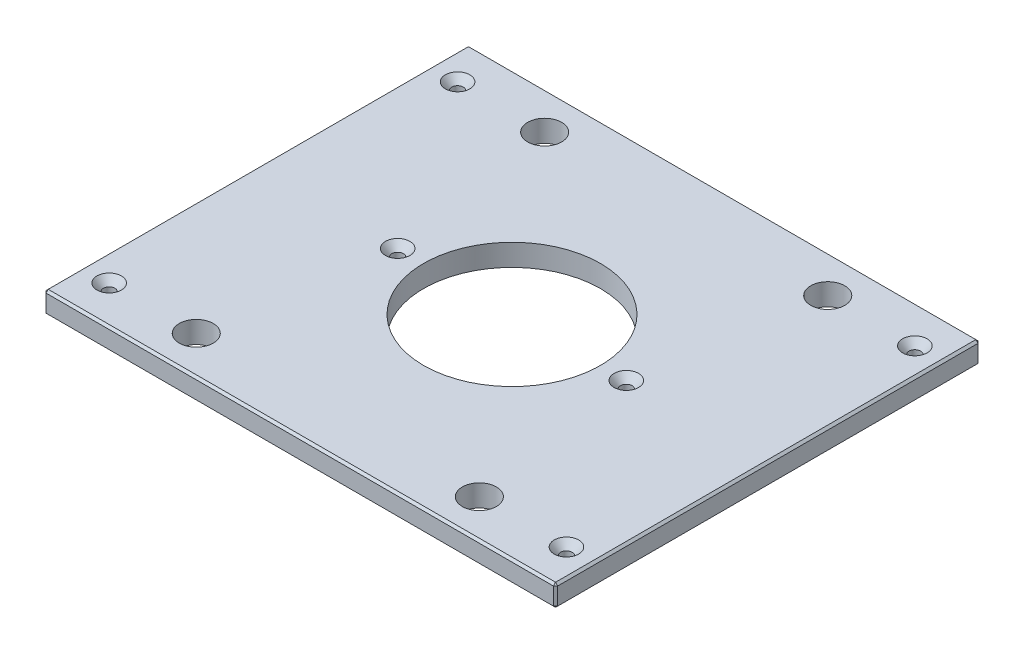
ISO-10303-21;
HEADER;
FILE_DESCRIPTION(('STEP AP214'),'2;1');
FILE_NAME('part.step','',(''),(''),'','','');
FILE_SCHEMA(('AUTOMOTIVE_DESIGN { 1 0 10303 214 1 1 1 1 }'));
ENDSEC;
DATA;
#1=APPLICATION_CONTEXT('core data for automotive mechanical design processes');
#2=APPLICATION_PROTOCOL_DEFINITION('international standard','automotive_design',2000,#1);
#3=PRODUCT_CONTEXT('',#1,'mechanical');
#4=PRODUCT('Part','Part','',(#3));
#5=PRODUCT_RELATED_PRODUCT_CATEGORY('part','',(#4));
#6=PRODUCT_DEFINITION_FORMATION('','',#4);
#7=PRODUCT_DEFINITION_CONTEXT('part definition',#1,'design');
#8=PRODUCT_DEFINITION('design','',#6,#7);
#9=PRODUCT_DEFINITION_SHAPE('','',#8);
#10=(LENGTH_UNIT() NAMED_UNIT(*) SI_UNIT(.MILLI.,.METRE.));
#11=(NAMED_UNIT(*) PLANE_ANGLE_UNIT() SI_UNIT($,.RADIAN.));
#12=(NAMED_UNIT(*) SI_UNIT($,.STERADIAN.) SOLID_ANGLE_UNIT());
#13=UNCERTAINTY_MEASURE_WITH_UNIT(LENGTH_MEASURE(1.E-05),#10,'distance_accuracy_value','');
#14=(GEOMETRIC_REPRESENTATION_CONTEXT(3) GLOBAL_UNCERTAINTY_ASSIGNED_CONTEXT((#13)) GLOBAL_UNIT_ASSIGNED_CONTEXT((#10,
#11,#12)) REPRESENTATION_CONTEXT('',''));
#15=CARTESIAN_POINT('',(0.,0.,0.));
#16=DIRECTION('',(0.,0.,1.));
#17=DIRECTION('',(1.,0.,0.));
#18=AXIS2_PLACEMENT_3D('',#15,#16,#17);
#19=CARTESIAN_POINT('',(-149.225,12.7,-123.825));
#20=DIRECTION('',(1.,0.,0.));
#21=DIRECTION('',(0.,0.,-1.));
#22=AXIS2_PLACEMENT_3D('',#19,#20,#21);
#23=PLANE('',#22);
#24=DIRECTION('',(0.,0.,-1.));
#25=VECTOR('',#24,1.);
#26=CARTESIAN_POINT('',(-149.225,11.4299999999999,-123.825));
#27=LINE('',#26,#25);
#28=CARTESIAN_POINT('',(-149.225,11.4299999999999,122.555));
#29=VERTEX_POINT('',#28);
#30=CARTESIAN_POINT('',(-149.225,11.4299999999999,-122.555));
#31=VERTEX_POINT('',#30);
#32=EDGE_CURVE('E136',#29,#31,#27,.T.);
#33=ORIENTED_EDGE('',*,*,#32,.T.);
#34=DIRECTION('',(0.,-1.,0.));
#35=VECTOR('',#34,1.);
#36=CARTESIAN_POINT('',(-149.225,12.7,-122.555));
#37=LINE('',#36,#35);
#38=CARTESIAN_POINT('',(-149.225,1.27000000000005,-122.555));
#39=VERTEX_POINT('',#38);
#40=EDGE_CURVE('E132',#31,#39,#37,.T.);
#41=ORIENTED_EDGE('',*,*,#40,.T.);
#42=DIRECTION('',(0.,0.,1.));
#43=VECTOR('',#42,1.);
#44=CARTESIAN_POINT('',(-149.225,1.27000000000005,-123.825));
#45=LINE('',#44,#43);
#46=CARTESIAN_POINT('',(-149.225,1.27000000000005,122.555));
#47=VERTEX_POINT('',#46);
#48=EDGE_CURVE('E127',#39,#47,#45,.T.);
#49=ORIENTED_EDGE('',*,*,#48,.T.);
#50=DIRECTION('',(0.,1.,0.));
#51=VECTOR('',#50,1.);
#52=CARTESIAN_POINT('',(-149.225,12.7,122.555));
#53=LINE('',#52,#51);
#54=EDGE_CURVE('E129',#47,#29,#53,.T.);
#55=ORIENTED_EDGE('',*,*,#54,.T.);
#56=EDGE_LOOP('',(#33,#41,#49,#55));
#57=FACE_BOUND('',#56,.T.);
#58=ADVANCED_FACE('F36',(#57),#23,.F.);
#59=CARTESIAN_POINT('',(-149.225,12.7,123.825));
#60=DIRECTION('',(0.,0.,-1.));
#61=DIRECTION('',(-1.,0.,0.));
#62=AXIS2_PLACEMENT_3D('',#59,#60,#61);
#63=PLANE('',#62);
#64=DIRECTION('',(1.,0.,0.));
#65=VECTOR('',#64,1.);
#66=CARTESIAN_POINT('',(-149.225,1.27000000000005,123.825));
#67=LINE('',#66,#65);
#68=CARTESIAN_POINT('',(-147.955,1.27000000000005,123.825));
#69=VERTEX_POINT('',#68);
#70=CARTESIAN_POINT('',(147.955,1.27000000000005,123.825));
#71=VERTEX_POINT('',#70);
#72=EDGE_CURVE('E59',#69,#71,#67,.T.);
#73=ORIENTED_EDGE('',*,*,#72,.T.);
#74=DIRECTION('',(0.,1.,0.));
#75=VECTOR('',#74,1.);
#76=CARTESIAN_POINT('',(147.955,12.7,123.825));
#77=LINE('',#76,#75);
#78=CARTESIAN_POINT('',(147.955,11.4299999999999,123.825));
#79=VERTEX_POINT('',#78);
#80=EDGE_CURVE('E11',#71,#79,#77,.T.);
#81=ORIENTED_EDGE('',*,*,#80,.T.);
#82=DIRECTION('',(-1.,0.,0.));
#83=VECTOR('',#82,1.);
#84=CARTESIAN_POINT('',(-149.225,11.4299999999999,123.825));
#85=LINE('',#84,#83);
#86=CARTESIAN_POINT('',(-147.955,11.4299999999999,123.825));
#87=VERTEX_POINT('',#86);
#88=EDGE_CURVE('E45',#79,#87,#85,.T.);
#89=ORIENTED_EDGE('',*,*,#88,.T.);
#90=DIRECTION('',(0.,-1.,0.));
#91=VECTOR('',#90,1.);
#92=CARTESIAN_POINT('',(-147.955,12.7,123.825));
#93=LINE('',#92,#91);
#94=EDGE_CURVE('E280',#87,#69,#93,.T.);
#95=ORIENTED_EDGE('',*,*,#94,.T.);
#96=EDGE_LOOP('',(#73,#81,#89,#95));
#97=FACE_BOUND('',#96,.T.);
#98=ADVANCED_FACE('F349',(#97),#63,.F.);
#99=CARTESIAN_POINT('',(149.225,12.7,-123.825));
#100=DIRECTION('',(-1.,0.,0.));
#101=DIRECTION('',(0.,0.,1.));
#102=AXIS2_PLACEMENT_3D('',#99,#100,#101);
#103=PLANE('',#102);
#104=DIRECTION('',(0.,0.,-1.));
#105=VECTOR('',#104,1.);
#106=CARTESIAN_POINT('',(149.225,1.27000000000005,-123.825));
#107=LINE('',#106,#105);
#108=CARTESIAN_POINT('',(149.225,1.27000000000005,122.555));
#109=VERTEX_POINT('',#108);
#110=CARTESIAN_POINT('',(149.225,1.27000000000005,-122.555));
#111=VERTEX_POINT('',#110);
#112=EDGE_CURVE('E275',#109,#111,#107,.T.);
#113=ORIENTED_EDGE('',*,*,#112,.T.);
#114=DIRECTION('',(0.,1.,0.));
#115=VECTOR('',#114,1.);
#116=CARTESIAN_POINT('',(149.225,12.7,-122.555));
#117=LINE('',#116,#115);
#118=CARTESIAN_POINT('',(149.225,11.4299999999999,-122.555));
#119=VERTEX_POINT('',#118);
#120=EDGE_CURVE('E277',#111,#119,#117,.T.);
#121=ORIENTED_EDGE('',*,*,#120,.T.);
#122=DIRECTION('',(0.,0.,1.));
#123=VECTOR('',#122,1.);
#124=CARTESIAN_POINT('',(149.225,11.4299999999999,123.825));
#125=LINE('',#124,#123);
#126=CARTESIAN_POINT('',(149.225,11.4299999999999,122.555));
#127=VERTEX_POINT('',#126);
#128=EDGE_CURVE('E273',#119,#127,#125,.T.);
#129=ORIENTED_EDGE('',*,*,#128,.T.);
#130=DIRECTION('',(0.,-1.,0.));
#131=VECTOR('',#130,1.);
#132=CARTESIAN_POINT('',(149.225,12.7,122.555));
#133=LINE('',#132,#131);
#134=EDGE_CURVE('E271',#127,#109,#133,.T.);
#135=ORIENTED_EDGE('',*,*,#134,.T.);
#136=EDGE_LOOP('',(#113,#121,#129,#135));
#137=FACE_BOUND('',#136,.T.);
#138=ADVANCED_FACE('F336',(#137),#103,.F.);
#139=CARTESIAN_POINT('',(-149.225,12.7,-123.825));
#140=DIRECTION('',(0.,0.,1.));
#141=DIRECTION('',(1.,0.,0.));
#142=AXIS2_PLACEMENT_3D('',#139,#140,#141);
#143=PLANE('',#142);
#144=DIRECTION('',(-1.,0.,0.));
#145=VECTOR('',#144,1.);
#146=CARTESIAN_POINT('',(-149.225,1.27000000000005,-123.825));
#147=LINE('',#146,#145);
#148=CARTESIAN_POINT('',(147.955,1.27000000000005,-123.825));
#149=VERTEX_POINT('',#148);
#150=CARTESIAN_POINT('',(-147.955,1.27000000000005,-123.825));
#151=VERTEX_POINT('',#150);
#152=EDGE_CURVE('E247',#149,#151,#147,.T.);
#153=ORIENTED_EDGE('',*,*,#152,.T.);
#154=DIRECTION('',(0.,1.,0.));
#155=VECTOR('',#154,1.);
#156=CARTESIAN_POINT('',(-147.955,12.7,-123.825));
#157=LINE('',#156,#155);
#158=CARTESIAN_POINT('',(-147.955,11.4299999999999,-123.825));
#159=VERTEX_POINT('',#158);
#160=EDGE_CURVE('E251',#151,#159,#157,.T.);
#161=ORIENTED_EDGE('',*,*,#160,.T.);
#162=DIRECTION('',(1.,0.,0.));
#163=VECTOR('',#162,1.);
#164=CARTESIAN_POINT('',(149.225,11.4299999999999,-123.825));
#165=LINE('',#164,#163);
#166=CARTESIAN_POINT('',(147.955,11.4299999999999,-123.825));
#167=VERTEX_POINT('',#166);
#168=EDGE_CURVE('E249',#159,#167,#165,.T.);
#169=ORIENTED_EDGE('',*,*,#168,.T.);
#170=DIRECTION('',(0.,-1.,0.));
#171=VECTOR('',#170,1.);
#172=CARTESIAN_POINT('',(147.955,12.7,-123.825));
#173=LINE('',#172,#171);
#174=EDGE_CURVE('E245',#167,#149,#173,.T.);
#175=ORIENTED_EDGE('',*,*,#174,.T.);
#176=EDGE_LOOP('',(#153,#161,#169,#175));
#177=FACE_BOUND('',#176,.T.);
#178=ADVANCED_FACE('F310',(#177),#143,.F.);
#179=CARTESIAN_POINT('',(0.,12.7,0.));
#180=DIRECTION('',(0.,1.,0.));
#181=DIRECTION('',(0.,0.,1.));
#182=AXIS2_PLACEMENT_3D('',#179,#180,#181);
#183=PLANE('',#182);
#184=CARTESIAN_POINT('',(133.35,12.7,-101.6));
#185=DIRECTION('',(0.,1.,0.));
#186=DIRECTION('',(0.,0.,1.));
#187=AXIS2_PLACEMENT_3D('',#184,#185,#186);
#188=CIRCLE('',#187,7.13739999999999);
#189=CARTESIAN_POINT('',(133.35,12.7,-94.4626));
#190=VERTEX_POINT('',#189);
#191=EDGE_CURVE('E753',#190,#190,#188,.T.);
#192=ORIENTED_EDGE('',*,*,#191,.F.);
#193=EDGE_LOOP('',(#192));
#194=FACE_BOUND('',#193,.T.);
#195=CARTESIAN_POINT('',(133.35,12.7,101.6));
#196=DIRECTION('',(0.,1.,0.));
#197=DIRECTION('',(0.,0.,1.));
#198=AXIS2_PLACEMENT_3D('',#195,#196,#197);
#199=CIRCLE('',#198,7.13739999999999);
#200=CARTESIAN_POINT('',(133.35,12.7,108.7374));
#201=VERTEX_POINT('',#200);
#202=EDGE_CURVE('E757',#201,#201,#199,.T.);
#203=ORIENTED_EDGE('',*,*,#202,.F.);
#204=EDGE_LOOP('',(#203));
#205=FACE_BOUND('',#204,.T.);
#206=CARTESIAN_POINT('',(-133.35,12.7,101.6));
#207=DIRECTION('',(0.,1.,0.));
#208=DIRECTION('',(0.,0.,1.));
#209=AXIS2_PLACEMENT_3D('',#206,#207,#208);
#210=CIRCLE('',#209,7.13739999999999);
#211=CARTESIAN_POINT('',(-133.35,12.7,108.7374));
#212=VERTEX_POINT('',#211);
#213=EDGE_CURVE('E761',#212,#212,#210,.T.);
#214=ORIENTED_EDGE('',*,*,#213,.F.);
#215=EDGE_LOOP('',(#214));
#216=FACE_BOUND('',#215,.T.);
#217=CARTESIAN_POINT('',(-66.675,12.7,0.));
#218=DIRECTION('',(0.,1.,0.));
#219=DIRECTION('',(0.,0.,1.));
#220=AXIS2_PLACEMENT_3D('',#217,#218,#219);
#221=CIRCLE('',#220,7.1374);
#222=CARTESIAN_POINT('',(-66.675,12.7,7.1374));
#223=VERTEX_POINT('',#222);
#224=EDGE_CURVE('E765',#223,#223,#221,.T.);
#225=ORIENTED_EDGE('',*,*,#224,.F.);
#226=EDGE_LOOP('',(#225));
#227=FACE_BOUND('',#226,.T.);
#228=CARTESIAN_POINT('',(66.675,12.7,0.));
#229=DIRECTION('',(0.,1.,0.));
#230=DIRECTION('',(0.,0.,1.));
#231=AXIS2_PLACEMENT_3D('',#228,#229,#230);
#232=CIRCLE('',#231,7.1374);
#233=CARTESIAN_POINT('',(66.675,12.7,7.1374));
#234=VERTEX_POINT('',#233);
#235=EDGE_CURVE('E769',#234,#234,#232,.T.);
#236=ORIENTED_EDGE('',*,*,#235,.F.);
#237=EDGE_LOOP('',(#236));
#238=FACE_BOUND('',#237,.T.);
#239=CARTESIAN_POINT('',(-133.35,12.7,-101.6));
#240=DIRECTION('',(0.,1.,0.));
#241=DIRECTION('',(0.,0.,1.));
#242=AXIS2_PLACEMENT_3D('',#239,#240,#241);
#243=CIRCLE('',#242,7.13739999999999);
#244=CARTESIAN_POINT('',(-133.35,12.7,-94.4626));
#245=VERTEX_POINT('',#244);
#246=EDGE_CURVE('E772',#245,#245,#243,.T.);
#247=ORIENTED_EDGE('',*,*,#246,.F.);
#248=EDGE_LOOP('',(#247));
#249=FACE_BOUND('',#248,.T.);
#250=DIRECTION('',(0.,0.,-1.));
#251=VECTOR('',#250,1.);
#252=CARTESIAN_POINT('',(147.955,12.7,-123.825));
#253=LINE('',#252,#251);
#254=CARTESIAN_POINT('',(147.955,12.7,122.555));
#255=VERTEX_POINT('',#254);
#256=CARTESIAN_POINT('',(147.955,12.7,-122.555));
#257=VERTEX_POINT('',#256);
#258=EDGE_CURVE('E258',#255,#257,#253,.T.);
#259=ORIENTED_EDGE('',*,*,#258,.T.);
#260=DIRECTION('',(-1.,0.,0.));
#261=VECTOR('',#260,1.);
#262=CARTESIAN_POINT('',(-149.225,12.7,-122.555));
#263=LINE('',#262,#261);
#264=CARTESIAN_POINT('',(-147.955,12.7,-122.555));
#265=VERTEX_POINT('',#264);
#266=EDGE_CURVE('E260',#257,#265,#263,.T.);
#267=ORIENTED_EDGE('',*,*,#266,.T.);
#268=DIRECTION('',(0.,0.,1.));
#269=VECTOR('',#268,1.);
#270=CARTESIAN_POINT('',(-147.955,12.7,123.825));
#271=LINE('',#270,#269);
#272=CARTESIAN_POINT('',(-147.955,12.7,122.555));
#273=VERTEX_POINT('',#272);
#274=EDGE_CURVE('E256',#265,#273,#271,.T.);
#275=ORIENTED_EDGE('',*,*,#274,.T.);
#276=DIRECTION('',(1.,0.,0.));
#277=VECTOR('',#276,1.);
#278=CARTESIAN_POINT('',(149.225,12.7,122.555));
#279=LINE('',#278,#277);
#280=EDGE_CURVE('E254',#273,#255,#279,.T.);
#281=ORIENTED_EDGE('',*,*,#280,.T.);
#282=EDGE_LOOP('',(#259,#267,#275,#281));
#283=FACE_BOUND('',#282,.T.);
#284=CARTESIAN_POINT('',(82.55,12.7,-101.6));
#285=DIRECTION('',(0.,1.,0.));
#286=DIRECTION('',(0.,0.,1.));
#287=AXIS2_PLACEMENT_3D('',#284,#285,#286);
#288=CIRCLE('',#287,9.921875);
#289=CARTESIAN_POINT('',(82.55,12.7,-91.678125));
#290=VERTEX_POINT('',#289);
#291=EDGE_CURVE('E205',#290,#290,#288,.T.);
#292=ORIENTED_EDGE('',*,*,#291,.F.);
#293=EDGE_LOOP('',(#292));
#294=FACE_BOUND('',#293,.T.);
#295=CARTESIAN_POINT('',(-82.55,12.7,-101.6));
#296=DIRECTION('',(0.,1.,0.));
#297=DIRECTION('',(0.,0.,1.));
#298=AXIS2_PLACEMENT_3D('',#295,#296,#297);
#299=CIRCLE('',#298,9.921875);
#300=CARTESIAN_POINT('',(-82.55,12.7,-91.678125));
#301=VERTEX_POINT('',#300);
#302=EDGE_CURVE('E215',#301,#301,#299,.T.);
#303=ORIENTED_EDGE('',*,*,#302,.F.);
#304=EDGE_LOOP('',(#303));
#305=FACE_BOUND('',#304,.T.);
#306=CARTESIAN_POINT('',(82.55,12.7,101.6));
#307=DIRECTION('',(0.,1.,0.));
#308=DIRECTION('',(0.,0.,1.));
#309=AXIS2_PLACEMENT_3D('',#306,#307,#308);
#310=CIRCLE('',#309,9.921875);
#311=CARTESIAN_POINT('',(82.55,12.7,111.521875));
#312=VERTEX_POINT('',#311);
#313=EDGE_CURVE('E226',#312,#312,#310,.T.);
#314=ORIENTED_EDGE('',*,*,#313,.F.);
#315=EDGE_LOOP('',(#314));
#316=FACE_BOUND('',#315,.T.);
#317=CARTESIAN_POINT('',(-82.55,12.7,101.6));
#318=DIRECTION('',(0.,1.,0.));
#319=DIRECTION('',(0.,0.,1.));
#320=AXIS2_PLACEMENT_3D('',#317,#318,#319);
#321=CIRCLE('',#320,9.921875);
#322=CARTESIAN_POINT('',(-82.55,12.7,111.521875));
#323=VERTEX_POINT('',#322);
#324=EDGE_CURVE('E232',#323,#323,#321,.T.);
#325=ORIENTED_EDGE('',*,*,#324,.F.);
#326=EDGE_LOOP('',(#325));
#327=FACE_BOUND('',#326,.T.);
#328=CARTESIAN_POINT('',(0.,12.7,0.));
#329=DIRECTION('',(0.,1.,0.));
#330=DIRECTION('',(0.,0.,1.));
#331=AXIS2_PLACEMENT_3D('',#328,#329,#330);
#332=CIRCLE('',#331,51.562);
#333=CARTESIAN_POINT('',(0.,12.7,51.562));
#334=VERTEX_POINT('',#333);
#335=EDGE_CURVE('E238',#334,#334,#332,.T.);
#336=ORIENTED_EDGE('',*,*,#335,.F.);
#337=EDGE_LOOP('',(#336));
#338=FACE_BOUND('',#337,.T.);
#339=ADVANCED_FACE('F358',(#194,#205,#216,#227,#238,#249,#283,#294,#305,#316,#327,#338),#183,.T.);
#340=CARTESIAN_POINT('',(0.,0.,0.));
#341=DIRECTION('',(0.,1.,0.));
#342=DIRECTION('',(0.,0.,1.));
#343=AXIS2_PLACEMENT_3D('',#340,#341,#342);
#344=PLANE('',#343);
#345=CARTESIAN_POINT('',(133.35,0.,-101.6));
#346=DIRECTION('',(0.,1.,0.));
#347=DIRECTION('',(0.,0.,1.));
#348=AXIS2_PLACEMENT_3D('',#345,#346,#347);
#349=CIRCLE('',#348,3.3782);
#350=CARTESIAN_POINT('',(133.35,0.,-98.2218));
#351=VERTEX_POINT('',#350);
#352=EDGE_CURVE('E806',#351,#351,#349,.T.);
#353=ORIENTED_EDGE('',*,*,#352,.T.);
#354=EDGE_LOOP('',(#353));
#355=FACE_BOUND('',#354,.T.);
#356=CARTESIAN_POINT('',(133.35,0.,101.6));
#357=DIRECTION('',(0.,1.,0.));
#358=DIRECTION('',(0.,0.,1.));
#359=AXIS2_PLACEMENT_3D('',#356,#357,#358);
#360=CIRCLE('',#359,3.3782);
#361=CARTESIAN_POINT('',(133.35,0.,104.9782));
#362=VERTEX_POINT('',#361);
#363=EDGE_CURVE('E799',#362,#362,#360,.T.);
#364=ORIENTED_EDGE('',*,*,#363,.T.);
#365=EDGE_LOOP('',(#364));
#366=FACE_BOUND('',#365,.T.);
#367=CARTESIAN_POINT('',(-133.35,0.,101.6));
#368=DIRECTION('',(0.,1.,0.));
#369=DIRECTION('',(0.,0.,1.));
#370=AXIS2_PLACEMENT_3D('',#367,#368,#369);
#371=CIRCLE('',#370,3.3782);
#372=CARTESIAN_POINT('',(-133.35,0.,104.9782));
#373=VERTEX_POINT('',#372);
#374=EDGE_CURVE('E792',#373,#373,#371,.T.);
#375=ORIENTED_EDGE('',*,*,#374,.T.);
#376=EDGE_LOOP('',(#375));
#377=FACE_BOUND('',#376,.T.);
#378=CARTESIAN_POINT('',(-66.675,0.,0.));
#379=DIRECTION('',(0.,1.,0.));
#380=DIRECTION('',(0.,0.,1.));
#381=AXIS2_PLACEMENT_3D('',#378,#379,#380);
#382=CIRCLE('',#381,3.3782);
#383=CARTESIAN_POINT('',(-66.675,0.,3.3782));
#384=VERTEX_POINT('',#383);
#385=EDGE_CURVE('E785',#384,#384,#382,.T.);
#386=ORIENTED_EDGE('',*,*,#385,.T.);
#387=EDGE_LOOP('',(#386));
#388=FACE_BOUND('',#387,.T.);
#389=CARTESIAN_POINT('',(66.675,0.,0.));
#390=DIRECTION('',(0.,1.,0.));
#391=DIRECTION('',(0.,0.,1.));
#392=AXIS2_PLACEMENT_3D('',#389,#390,#391);
#393=CIRCLE('',#392,3.3782);
#394=CARTESIAN_POINT('',(66.675,0.,3.3782));
#395=VERTEX_POINT('',#394);
#396=EDGE_CURVE('E775',#395,#395,#393,.T.);
#397=ORIENTED_EDGE('',*,*,#396,.T.);
#398=EDGE_LOOP('',(#397));
#399=FACE_BOUND('',#398,.T.);
#400=CARTESIAN_POINT('',(-133.35,0.,-101.6));
#401=DIRECTION('',(0.,1.,0.));
#402=DIRECTION('',(0.,0.,1.));
#403=AXIS2_PLACEMENT_3D('',#400,#401,#402);
#404=CIRCLE('',#403,3.3782);
#405=CARTESIAN_POINT('',(-133.35,0.,-98.2218));
#406=VERTEX_POINT('',#405);
#407=EDGE_CURVE('E218',#406,#406,#404,.T.);
#408=ORIENTED_EDGE('',*,*,#407,.T.);
#409=EDGE_LOOP('',(#408));
#410=FACE_BOUND('',#409,.T.);
#411=DIRECTION('',(0.,0.,-1.));
#412=VECTOR('',#411,1.);
#413=CARTESIAN_POINT('',(-147.955,0.,0.));
#414=LINE('',#413,#412);
#415=CARTESIAN_POINT('',(-147.955,0.,122.555));
#416=VERTEX_POINT('',#415);
#417=CARTESIAN_POINT('',(-147.955,0.,-122.555));
#418=VERTEX_POINT('',#417);
#419=EDGE_CURVE('E159',#416,#418,#414,.T.);
#420=ORIENTED_EDGE('',*,*,#419,.T.);
#421=DIRECTION('',(1.,0.,0.));
#422=VECTOR('',#421,1.);
#423=CARTESIAN_POINT('',(0.,0.,-122.555));
#424=LINE('',#423,#422);
#425=CARTESIAN_POINT('',(147.955,0.,-122.555));
#426=VERTEX_POINT('',#425);
#427=EDGE_CURVE('E268',#418,#426,#424,.T.);
#428=ORIENTED_EDGE('',*,*,#427,.T.);
#429=DIRECTION('',(0.,0.,1.));
#430=VECTOR('',#429,1.);
#431=CARTESIAN_POINT('',(147.955,0.,0.));
#432=LINE('',#431,#430);
#433=CARTESIAN_POINT('',(147.955,0.,122.555));
#434=VERTEX_POINT('',#433);
#435=EDGE_CURVE('E266',#426,#434,#432,.T.);
#436=ORIENTED_EDGE('',*,*,#435,.T.);
#437=DIRECTION('',(-1.,0.,0.));
#438=VECTOR('',#437,1.);
#439=CARTESIAN_POINT('',(0.,0.,122.555));
#440=LINE('',#439,#438);
#441=EDGE_CURVE('E263',#434,#416,#440,.T.);
#442=ORIENTED_EDGE('',*,*,#441,.T.);
#443=EDGE_LOOP('',(#420,#428,#436,#442));
#444=FACE_BOUND('',#443,.T.);
#445=CARTESIAN_POINT('',(82.55,0.,-101.6));
#446=DIRECTION('',(0.,1.,0.));
#447=DIRECTION('',(0.,0.,1.));
#448=AXIS2_PLACEMENT_3D('',#445,#446,#447);
#449=CIRCLE('',#448,9.921875);
#450=CARTESIAN_POINT('',(82.55,0.,-91.678125));
#451=VERTEX_POINT('',#450);
#452=EDGE_CURVE('E210',#451,#451,#449,.T.);
#453=ORIENTED_EDGE('',*,*,#452,.T.);
#454=EDGE_LOOP('',(#453));
#455=FACE_BOUND('',#454,.T.);
#456=CARTESIAN_POINT('',(-82.55,0.,-101.6));
#457=DIRECTION('',(0.,1.,0.));
#458=DIRECTION('',(0.,0.,1.));
#459=AXIS2_PLACEMENT_3D('',#456,#457,#458);
#460=CIRCLE('',#459,9.921875);
#461=CARTESIAN_POINT('',(-82.55,0.,-91.678125));
#462=VERTEX_POINT('',#461);
#463=EDGE_CURVE('E223',#462,#462,#460,.T.);
#464=ORIENTED_EDGE('',*,*,#463,.T.);
#465=EDGE_LOOP('',(#464));
#466=FACE_BOUND('',#465,.T.);
#467=CARTESIAN_POINT('',(82.55,0.,101.6));
#468=DIRECTION('',(0.,1.,0.));
#469=DIRECTION('',(0.,0.,1.));
#470=AXIS2_PLACEMENT_3D('',#467,#468,#469);
#471=CIRCLE('',#470,9.921875);
#472=CARTESIAN_POINT('',(82.55,0.,111.521875));
#473=VERTEX_POINT('',#472);
#474=EDGE_CURVE('E229',#473,#473,#471,.T.);
#475=ORIENTED_EDGE('',*,*,#474,.T.);
#476=EDGE_LOOP('',(#475));
#477=FACE_BOUND('',#476,.T.);
#478=CARTESIAN_POINT('',(-82.55,0.,101.6));
#479=DIRECTION('',(0.,1.,0.));
#480=DIRECTION('',(0.,0.,1.));
#481=AXIS2_PLACEMENT_3D('',#478,#479,#480);
#482=CIRCLE('',#481,9.921875);
#483=CARTESIAN_POINT('',(-82.55,0.,111.521875));
#484=VERTEX_POINT('',#483);
#485=EDGE_CURVE('E235',#484,#484,#482,.T.);
#486=ORIENTED_EDGE('',*,*,#485,.T.);
#487=EDGE_LOOP('',(#486));
#488=FACE_BOUND('',#487,.T.);
#489=CARTESIAN_POINT('',(0.,0.,0.));
#490=DIRECTION('',(0.,1.,0.));
#491=DIRECTION('',(0.,0.,1.));
#492=AXIS2_PLACEMENT_3D('',#489,#490,#491);
#493=CIRCLE('',#492,51.562);
#494=CARTESIAN_POINT('',(0.,0.,51.562));
#495=VERTEX_POINT('',#494);
#496=EDGE_CURVE('E148',#495,#495,#493,.T.);
#497=ORIENTED_EDGE('',*,*,#496,.T.);
#498=EDGE_LOOP('',(#497));
#499=FACE_BOUND('',#498,.T.);
#500=ADVANCED_FACE('F323',(#355,#366,#377,#388,#399,#410,#444,#455,#466,#477,#488,#499),#344,.F.);
#501=CARTESIAN_POINT('',(0.,0.,0.));
#502=DIRECTION('',(0.,1.,0.));
#503=DIRECTION('',(0.,0.,1.));
#504=AXIS2_PLACEMENT_3D('',#501,#502,#503);
#505=CYLINDRICAL_SURFACE('',#504,51.562);
#506=ORIENTED_EDGE('',*,*,#496,.F.);
#507=EDGE_LOOP('',(#506));
#508=FACE_BOUND('',#507,.T.);
#509=ORIENTED_EDGE('',*,*,#335,.T.);
#510=EDGE_LOOP('',(#509));
#511=FACE_BOUND('',#510,.T.);
#512=ADVANCED_FACE('F692',(#508,#511),#505,.F.);
#513=CARTESIAN_POINT('',(-82.55,12.7,101.6));
#514=DIRECTION('',(0.,1.,0.));
#515=DIRECTION('',(0.,0.,1.));
#516=AXIS2_PLACEMENT_3D('',#513,#514,#515);
#517=CYLINDRICAL_SURFACE('',#516,9.921875);
#518=ORIENTED_EDGE('',*,*,#485,.F.);
#519=EDGE_LOOP('',(#518));
#520=FACE_BOUND('',#519,.T.);
#521=ORIENTED_EDGE('',*,*,#324,.T.);
#522=EDGE_LOOP('',(#521));
#523=FACE_BOUND('',#522,.T.);
#524=ADVANCED_FACE('F683',(#520,#523),#517,.F.);
#525=CARTESIAN_POINT('',(82.55,12.7,101.6));
#526=DIRECTION('',(0.,1.,0.));
#527=DIRECTION('',(0.,0.,1.));
#528=AXIS2_PLACEMENT_3D('',#525,#526,#527);
#529=CYLINDRICAL_SURFACE('',#528,9.921875);
#530=ORIENTED_EDGE('',*,*,#474,.F.);
#531=EDGE_LOOP('',(#530));
#532=FACE_BOUND('',#531,.T.);
#533=ORIENTED_EDGE('',*,*,#313,.T.);
#534=EDGE_LOOP('',(#533));
#535=FACE_BOUND('',#534,.T.);
#536=ADVANCED_FACE('F674',(#532,#535),#529,.F.);
#537=CARTESIAN_POINT('',(-82.55,12.7,-101.6));
#538=DIRECTION('',(0.,1.,0.));
#539=DIRECTION('',(0.,0.,1.));
#540=AXIS2_PLACEMENT_3D('',#537,#538,#539);
#541=CYLINDRICAL_SURFACE('',#540,9.921875);
#542=ORIENTED_EDGE('',*,*,#463,.F.);
#543=EDGE_LOOP('',(#542));
#544=FACE_BOUND('',#543,.T.);
#545=ORIENTED_EDGE('',*,*,#302,.T.);
#546=EDGE_LOOP('',(#545));
#547=FACE_BOUND('',#546,.T.);
#548=ADVANCED_FACE('F664',(#544,#547),#541,.F.);
#549=CARTESIAN_POINT('',(82.55,12.7,-101.6));
#550=DIRECTION('',(0.,1.,0.));
#551=DIRECTION('',(0.,0.,1.));
#552=AXIS2_PLACEMENT_3D('',#549,#550,#551);
#553=CYLINDRICAL_SURFACE('',#552,9.921875);
#554=ORIENTED_EDGE('',*,*,#452,.F.);
#555=EDGE_LOOP('',(#554));
#556=FACE_BOUND('',#555,.T.);
#557=ORIENTED_EDGE('',*,*,#291,.T.);
#558=EDGE_LOOP('',(#557));
#559=FACE_BOUND('',#558,.T.);
#560=ADVANCED_FACE('F367',(#556,#559),#553,.F.);
#561=CARTESIAN_POINT('',(149.225,12.7,122.555));
#562=DIRECTION('',(-0.707106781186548,0.,-0.707106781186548));
#563=DIRECTION('',(0.,-1.,0.));
#564=AXIS2_PLACEMENT_3D('',#561,#562,#563);
#565=PLANE('',#564);
#566=DIRECTION('',(-0.707106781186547,0.,0.707106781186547));
#567=VECTOR('',#566,1.);
#568=CARTESIAN_POINT('',(149.225,11.4299999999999,122.555));
#569=LINE('',#568,#567);
#570=EDGE_CURVE('E40',#79,#127,#569,.F.);
#571=ORIENTED_EDGE('',*,*,#570,.F.);
#572=ORIENTED_EDGE('',*,*,#80,.F.);
#573=DIRECTION('',(0.707106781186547,0.,-0.707106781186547));
#574=VECTOR('',#573,1.);
#575=CARTESIAN_POINT('',(148.59,1.27000000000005,123.19));
#576=LINE('',#575,#574);
#577=EDGE_CURVE('E198',#109,#71,#576,.F.);
#578=ORIENTED_EDGE('',*,*,#577,.F.);
#579=ORIENTED_EDGE('',*,*,#134,.F.);
#580=EDGE_LOOP('',(#571,#572,#578,#579));
#581=FACE_BOUND('',#580,.T.);
#582=ADVANCED_FACE('F38',(#581),#565,.F.);
#583=CARTESIAN_POINT('',(149.225,11.4299999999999,122.555));
#584=DIRECTION('',(0.577350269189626,0.577350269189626,0.577350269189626));
#585=DIRECTION('',(0.707106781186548,0.,-0.707106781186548));
#586=AXIS2_PLACEMENT_3D('',#583,#584,#585);
#587=PLANE('',#586);
#588=DIRECTION('',(0.,-0.707106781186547,0.707106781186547));
#589=VECTOR('',#588,1.);
#590=CARTESIAN_POINT('',(147.955,12.065,123.19));
#591=LINE('',#590,#589);
#592=EDGE_CURVE('E194',#79,#255,#591,.F.);
#593=ORIENTED_EDGE('',*,*,#592,.F.);
#594=ORIENTED_EDGE('',*,*,#570,.T.);
#595=DIRECTION('',(-0.707106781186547,0.707106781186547,0.));
#596=VECTOR('',#595,1.);
#597=CARTESIAN_POINT('',(149.225,11.4299999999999,122.555));
#598=LINE('',#597,#596);
#599=EDGE_CURVE('E196',#255,#127,#598,.F.);
#600=ORIENTED_EDGE('',*,*,#599,.F.);
#601=EDGE_LOOP('',(#593,#594,#600));
#602=FACE_BOUND('',#601,.T.);
#603=ADVANCED_FACE('F360',(#602),#587,.T.);
#604=CARTESIAN_POINT('',(147.955,0.,122.555));
#605=DIRECTION('',(0.577350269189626,-0.577350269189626,0.577350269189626));
#606=DIRECTION('',(0.707106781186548,0.,-0.707106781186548));
#607=AXIS2_PLACEMENT_3D('',#604,#605,#606);
#608=PLANE('',#607);
#609=DIRECTION('',(-0.707106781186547,-0.707106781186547,0.));
#610=VECTOR('',#609,1.);
#611=CARTESIAN_POINT('',(147.955,0.,122.555));
#612=LINE('',#611,#610);
#613=EDGE_CURVE('E188',#109,#434,#612,.T.);
#614=ORIENTED_EDGE('',*,*,#613,.F.);
#615=ORIENTED_EDGE('',*,*,#577,.T.);
#616=DIRECTION('',(0.,0.707106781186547,0.707106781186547));
#617=VECTOR('',#616,1.);
#618=CARTESIAN_POINT('',(147.955,0.,122.555));
#619=LINE('',#618,#617);
#620=EDGE_CURVE('E191',#434,#71,#619,.T.);
#621=ORIENTED_EDGE('',*,*,#620,.F.);
#622=EDGE_LOOP('',(#614,#615,#621));
#623=FACE_BOUND('',#622,.T.);
#624=ADVANCED_FACE('F329',(#623),#608,.T.);
#625=CARTESIAN_POINT('',(147.955,12.7,0.));
#626=DIRECTION('',(0.707106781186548,0.707106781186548,0.));
#627=DIRECTION('',(0.,0.,1.));
#628=AXIS2_PLACEMENT_3D('',#625,#626,#627);
#629=PLANE('',#628);
#630=ORIENTED_EDGE('',*,*,#599,.T.);
#631=ORIENTED_EDGE('',*,*,#128,.F.);
#632=DIRECTION('',(0.707106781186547,-0.707106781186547,0.));
#633=VECTOR('',#632,1.);
#634=CARTESIAN_POINT('',(148.59,12.065,-122.555));
#635=LINE('',#634,#633);
#636=EDGE_CURVE('E183',#257,#119,#635,.T.);
#637=ORIENTED_EDGE('',*,*,#636,.F.);
#638=ORIENTED_EDGE('',*,*,#258,.F.);
#639=EDGE_LOOP('',(#630,#631,#637,#638));
#640=FACE_BOUND('',#639,.T.);
#641=ADVANCED_FACE('F346',(#640),#629,.T.);
#642=CARTESIAN_POINT('',(0.,12.7,122.555));
#643=DIRECTION('',(0.,0.707106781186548,0.707106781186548));
#644=DIRECTION('',(-1.,0.,0.));
#645=AXIS2_PLACEMENT_3D('',#642,#643,#644);
#646=PLANE('',#645);
#647=ORIENTED_EDGE('',*,*,#592,.T.);
#648=ORIENTED_EDGE('',*,*,#280,.F.);
#649=DIRECTION('',(0.,0.707106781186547,-0.707106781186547));
#650=VECTOR('',#649,1.);
#651=CARTESIAN_POINT('',(-147.955,12.7,122.555));
#652=LINE('',#651,#650);
#653=EDGE_CURVE('E180',#87,#273,#652,.T.);
#654=ORIENTED_EDGE('',*,*,#653,.F.);
#655=ORIENTED_EDGE('',*,*,#88,.F.);
#656=EDGE_LOOP('',(#647,#648,#654,#655));
#657=FACE_BOUND('',#656,.T.);
#658=ADVANCED_FACE('F351',(#657),#646,.T.);
#659=CARTESIAN_POINT('',(-147.955,12.7,123.825));
#660=DIRECTION('',(0.707106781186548,0.,-0.707106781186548));
#661=DIRECTION('',(0.,-1.,0.));
#662=AXIS2_PLACEMENT_3D('',#659,#660,#661);
#663=PLANE('',#662);
#664=DIRECTION('',(0.707106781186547,0.,0.707106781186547));
#665=VECTOR('',#664,1.);
#666=CARTESIAN_POINT('',(-149.225,1.27000000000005,122.555));
#667=LINE('',#666,#665);
#668=EDGE_CURVE('E143',#69,#47,#667,.F.);
#669=ORIENTED_EDGE('',*,*,#668,.F.);
#670=ORIENTED_EDGE('',*,*,#94,.F.);
#671=DIRECTION('',(-0.707106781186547,0.,-0.707106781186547));
#672=VECTOR('',#671,1.);
#673=CARTESIAN_POINT('',(-148.59,11.4299999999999,123.19));
#674=LINE('',#673,#672);
#675=EDGE_CURVE('E146',#29,#87,#674,.F.);
#676=ORIENTED_EDGE('',*,*,#675,.F.);
#677=ORIENTED_EDGE('',*,*,#54,.F.);
#678=EDGE_LOOP('',(#669,#670,#676,#677));
#679=FACE_BOUND('',#678,.T.);
#680=ADVANCED_FACE('F141',(#679),#663,.F.);
#681=CARTESIAN_POINT('',(-149.225,1.27000000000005,123.825));
#682=DIRECTION('',(0.,0.707106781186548,-0.707106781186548));
#683=DIRECTION('',(1.,0.,0.));
#684=AXIS2_PLACEMENT_3D('',#681,#682,#683);
#685=PLANE('',#684);
#686=ORIENTED_EDGE('',*,*,#620,.T.);
#687=ORIENTED_EDGE('',*,*,#72,.F.);
#688=DIRECTION('',(0.,-0.707106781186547,-0.707106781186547));
#689=VECTOR('',#688,1.);
#690=CARTESIAN_POINT('',(-147.955,0.635000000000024,123.19));
#691=LINE('',#690,#689);
#692=EDGE_CURVE('E156',#416,#69,#691,.F.);
#693=ORIENTED_EDGE('',*,*,#692,.F.);
#694=ORIENTED_EDGE('',*,*,#441,.F.);
#695=EDGE_LOOP('',(#686,#687,#693,#694));
#696=FACE_BOUND('',#695,.T.);
#697=ADVANCED_FACE('F328',(#696),#685,.F.);
#698=CARTESIAN_POINT('',(149.225,1.27000000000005,-123.825));
#699=DIRECTION('',(-0.707106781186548,0.707106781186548,0.));
#700=DIRECTION('',(0.,0.,-1.));
#701=AXIS2_PLACEMENT_3D('',#698,#699,#700);
#702=PLANE('',#701);
#703=ORIENTED_EDGE('',*,*,#613,.T.);
#704=ORIENTED_EDGE('',*,*,#435,.F.);
#705=DIRECTION('',(0.707106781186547,0.707106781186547,0.));
#706=VECTOR('',#705,1.);
#707=CARTESIAN_POINT('',(147.955,0.,-122.555));
#708=LINE('',#707,#706);
#709=EDGE_CURVE('E175',#111,#426,#708,.F.);
#710=ORIENTED_EDGE('',*,*,#709,.F.);
#711=ORIENTED_EDGE('',*,*,#112,.F.);
#712=EDGE_LOOP('',(#703,#704,#710,#711));
#713=FACE_BOUND('',#712,.T.);
#714=ADVANCED_FACE('F333',(#713),#702,.F.);
#715=CARTESIAN_POINT('',(147.955,12.7,-123.825));
#716=DIRECTION('',(-0.707106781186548,0.,0.707106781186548));
#717=DIRECTION('',(0.,-1.,0.));
#718=AXIS2_PLACEMENT_3D('',#715,#716,#717);
#719=PLANE('',#718);
#720=DIRECTION('',(0.707106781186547,0.,0.707106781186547));
#721=VECTOR('',#720,1.);
#722=CARTESIAN_POINT('',(147.955,11.4299999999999,-123.825));
#723=LINE('',#722,#721);
#724=EDGE_CURVE('E185',#119,#167,#723,.F.);
#725=ORIENTED_EDGE('',*,*,#724,.F.);
#726=ORIENTED_EDGE('',*,*,#120,.F.);
#727=DIRECTION('',(-0.707106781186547,0.,-0.707106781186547));
#728=VECTOR('',#727,1.);
#729=CARTESIAN_POINT('',(148.59,1.27000000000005,-123.19));
#730=LINE('',#729,#728);
#731=EDGE_CURVE('E172',#149,#111,#730,.F.);
#732=ORIENTED_EDGE('',*,*,#731,.F.);
#733=ORIENTED_EDGE('',*,*,#174,.F.);
#734=EDGE_LOOP('',(#725,#726,#732,#733));
#735=FACE_BOUND('',#734,.T.);
#736=ADVANCED_FACE('F341',(#735),#719,.F.);
#737=CARTESIAN_POINT('',(147.955,11.4299999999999,-123.825));
#738=DIRECTION('',(0.577350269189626,0.577350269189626,-0.577350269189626));
#739=DIRECTION('',(-0.707106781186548,0.,-0.707106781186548));
#740=AXIS2_PLACEMENT_3D('',#737,#738,#739);
#741=PLANE('',#740);
#742=ORIENTED_EDGE('',*,*,#636,.T.);
#743=ORIENTED_EDGE('',*,*,#724,.T.);
#744=DIRECTION('',(0.,0.707106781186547,0.707106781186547));
#745=VECTOR('',#744,1.);
#746=CARTESIAN_POINT('',(147.955,11.4299999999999,-123.825));
#747=LINE('',#746,#745);
#748=EDGE_CURVE('E164',#257,#167,#747,.F.);
#749=ORIENTED_EDGE('',*,*,#748,.F.);
#750=EDGE_LOOP('',(#742,#743,#749));
#751=FACE_BOUND('',#750,.T.);
#752=ADVANCED_FACE('F399',(#751),#741,.T.);
#753=CARTESIAN_POINT('',(-147.955,12.7,122.555));
#754=DIRECTION('',(-0.577350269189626,0.577350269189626,0.577350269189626));
#755=DIRECTION('',(0.707106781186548,0.,0.707106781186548));
#756=AXIS2_PLACEMENT_3D('',#753,#754,#755);
#757=PLANE('',#756);
#758=ORIENTED_EDGE('',*,*,#675,.T.);
#759=ORIENTED_EDGE('',*,*,#653,.T.);
#760=DIRECTION('',(-0.707106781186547,-0.707106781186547,0.));
#761=VECTOR('',#760,1.);
#762=CARTESIAN_POINT('',(-147.955,12.7,122.555));
#763=LINE('',#762,#761);
#764=EDGE_CURVE('E160',#29,#273,#763,.F.);
#765=ORIENTED_EDGE('',*,*,#764,.F.);
#766=EDGE_LOOP('',(#758,#759,#765));
#767=FACE_BOUND('',#766,.T.);
#768=ADVANCED_FACE('F353',(#767),#757,.T.);
#769=CARTESIAN_POINT('',(-149.225,1.27000000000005,122.555));
#770=DIRECTION('',(-0.577350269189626,-0.577350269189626,0.577350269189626));
#771=DIRECTION('',(0.707106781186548,0.,0.707106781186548));
#772=AXIS2_PLACEMENT_3D('',#769,#770,#771);
#773=PLANE('',#772);
#774=ORIENTED_EDGE('',*,*,#692,.T.);
#775=ORIENTED_EDGE('',*,*,#668,.T.);
#776=DIRECTION('',(-0.707106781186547,0.707106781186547,0.));
#777=VECTOR('',#776,1.);
#778=CARTESIAN_POINT('',(-149.225,1.27000000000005,122.555));
#779=LINE('',#778,#777);
#780=EDGE_CURVE('E153',#416,#47,#779,.T.);
#781=ORIENTED_EDGE('',*,*,#780,.F.);
#782=EDGE_LOOP('',(#774,#775,#781));
#783=FACE_BOUND('',#782,.T.);
#784=ADVANCED_FACE('F152',(#783),#773,.T.);
#785=CARTESIAN_POINT('',(147.955,0.,-122.555));
#786=DIRECTION('',(0.577350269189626,-0.577350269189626,-0.577350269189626));
#787=DIRECTION('',(-0.707106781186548,0.,-0.707106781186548));
#788=AXIS2_PLACEMENT_3D('',#785,#786,#787);
#789=PLANE('',#788);
#790=ORIENTED_EDGE('',*,*,#731,.T.);
#791=ORIENTED_EDGE('',*,*,#709,.T.);
#792=DIRECTION('',(0.,-0.707106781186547,0.707106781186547));
#793=VECTOR('',#792,1.);
#794=CARTESIAN_POINT('',(147.955,0.,-122.555));
#795=LINE('',#794,#793);
#796=EDGE_CURVE('E161',#149,#426,#795,.T.);
#797=ORIENTED_EDGE('',*,*,#796,.F.);
#798=EDGE_LOOP('',(#790,#791,#797));
#799=FACE_BOUND('',#798,.T.);
#800=ADVANCED_FACE('F391',(#799),#789,.T.);
#801=CARTESIAN_POINT('',(0.,12.7,-122.555));
#802=DIRECTION('',(0.,0.707106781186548,-0.707106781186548));
#803=DIRECTION('',(1.,0.,0.));
#804=AXIS2_PLACEMENT_3D('',#801,#802,#803);
#805=PLANE('',#804);
#806=ORIENTED_EDGE('',*,*,#748,.T.);
#807=ORIENTED_EDGE('',*,*,#168,.F.);
#808=DIRECTION('',(0.,-0.707106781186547,-0.707106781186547));
#809=VECTOR('',#808,1.);
#810=CARTESIAN_POINT('',(-147.955,11.4299999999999,-123.825));
#811=LINE('',#810,#809);
#812=EDGE_CURVE('E166',#265,#159,#811,.T.);
#813=ORIENTED_EDGE('',*,*,#812,.F.);
#814=ORIENTED_EDGE('',*,*,#266,.F.);
#815=EDGE_LOOP('',(#806,#807,#813,#814));
#816=FACE_BOUND('',#815,.T.);
#817=ADVANCED_FACE('F305',(#816),#805,.T.);
#818=CARTESIAN_POINT('',(-147.955,12.7,0.));
#819=DIRECTION('',(-0.707106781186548,0.707106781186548,0.));
#820=DIRECTION('',(0.,0.,-1.));
#821=AXIS2_PLACEMENT_3D('',#818,#819,#820);
#822=PLANE('',#821);
#823=ORIENTED_EDGE('',*,*,#764,.T.);
#824=ORIENTED_EDGE('',*,*,#274,.F.);
#825=DIRECTION('',(0.707106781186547,0.707106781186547,0.));
#826=VECTOR('',#825,1.);
#827=CARTESIAN_POINT('',(-148.59,12.065,-122.555));
#828=LINE('',#827,#826);
#829=EDGE_CURVE('E294',#31,#265,#828,.T.);
#830=ORIENTED_EDGE('',*,*,#829,.F.);
#831=ORIENTED_EDGE('',*,*,#32,.F.);
#832=EDGE_LOOP('',(#823,#824,#830,#831));
#833=FACE_BOUND('',#832,.T.);
#834=ADVANCED_FACE('F356',(#833),#822,.T.);
#835=CARTESIAN_POINT('',(-149.225,1.27000000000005,-123.825));
#836=DIRECTION('',(0.707106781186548,0.707106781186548,0.));
#837=DIRECTION('',(0.,0.,1.));
#838=AXIS2_PLACEMENT_3D('',#835,#836,#837);
#839=PLANE('',#838);
#840=ORIENTED_EDGE('',*,*,#780,.T.);
#841=ORIENTED_EDGE('',*,*,#48,.F.);
#842=DIRECTION('',(0.707106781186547,-0.707106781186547,0.));
#843=VECTOR('',#842,1.);
#844=CARTESIAN_POINT('',(-149.225,1.27000000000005,-122.555));
#845=LINE('',#844,#843);
#846=EDGE_CURVE('E291',#418,#39,#845,.F.);
#847=ORIENTED_EDGE('',*,*,#846,.F.);
#848=ORIENTED_EDGE('',*,*,#419,.F.);
#849=EDGE_LOOP('',(#840,#841,#847,#848));
#850=FACE_BOUND('',#849,.T.);
#851=ADVANCED_FACE('F158',(#850),#839,.F.);
#852=CARTESIAN_POINT('',(-149.225,1.27000000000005,-123.825));
#853=DIRECTION('',(0.,0.707106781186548,0.707106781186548));
#854=DIRECTION('',(-1.,0.,0.));
#855=AXIS2_PLACEMENT_3D('',#852,#853,#854);
#856=PLANE('',#855);
#857=ORIENTED_EDGE('',*,*,#796,.T.);
#858=ORIENTED_EDGE('',*,*,#427,.F.);
#859=DIRECTION('',(0.,0.707106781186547,-0.707106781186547));
#860=VECTOR('',#859,1.);
#861=CARTESIAN_POINT('',(-147.955,0.635000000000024,-123.19));
#862=LINE('',#861,#860);
#863=EDGE_CURVE('E288',#151,#418,#862,.F.);
#864=ORIENTED_EDGE('',*,*,#863,.F.);
#865=ORIENTED_EDGE('',*,*,#152,.F.);
#866=EDGE_LOOP('',(#857,#858,#864,#865));
#867=FACE_BOUND('',#866,.T.);
#868=ADVANCED_FACE('F320',(#867),#856,.F.);
#869=CARTESIAN_POINT('',(-147.955,11.4299999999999,-123.825));
#870=DIRECTION('',(-0.577350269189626,0.577350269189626,-0.577350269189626));
#871=DIRECTION('',(-0.707106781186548,0.,0.707106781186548));
#872=AXIS2_PLACEMENT_3D('',#869,#870,#871);
#873=PLANE('',#872);
#874=ORIENTED_EDGE('',*,*,#829,.T.);
#875=ORIENTED_EDGE('',*,*,#812,.T.);
#876=DIRECTION('',(0.707106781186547,0.,-0.707106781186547));
#877=VECTOR('',#876,1.);
#878=CARTESIAN_POINT('',(-147.955,11.4299999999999,-123.825));
#879=LINE('',#878,#877);
#880=EDGE_CURVE('E286',#31,#159,#879,.T.);
#881=ORIENTED_EDGE('',*,*,#880,.F.);
#882=EDGE_LOOP('',(#874,#875,#881));
#883=FACE_BOUND('',#882,.T.);
#884=ADVANCED_FACE('F300',(#883),#873,.T.);
#885=CARTESIAN_POINT('',(-149.225,1.27000000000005,-122.555));
#886=DIRECTION('',(-0.577350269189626,-0.577350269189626,-0.577350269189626));
#887=DIRECTION('',(-0.707106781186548,0.,0.707106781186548));
#888=AXIS2_PLACEMENT_3D('',#885,#886,#887);
#889=PLANE('',#888);
#890=ORIENTED_EDGE('',*,*,#863,.T.);
#891=ORIENTED_EDGE('',*,*,#846,.T.);
#892=DIRECTION('',(-0.707106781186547,0.,0.707106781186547));
#893=VECTOR('',#892,1.);
#894=CARTESIAN_POINT('',(-149.225,1.27000000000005,-122.555));
#895=LINE('',#894,#893);
#896=EDGE_CURVE('E284',#151,#39,#895,.T.);
#897=ORIENTED_EDGE('',*,*,#896,.F.);
#898=EDGE_LOOP('',(#890,#891,#897));
#899=FACE_BOUND('',#898,.T.);
#900=ADVANCED_FACE('F317',(#899),#889,.T.);
#901=CARTESIAN_POINT('',(-149.225,12.7,-122.555));
#902=DIRECTION('',(0.707106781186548,0.,0.707106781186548));
#903=DIRECTION('',(0.,-1.,0.));
#904=AXIS2_PLACEMENT_3D('',#901,#902,#903);
#905=PLANE('',#904);
#906=ORIENTED_EDGE('',*,*,#880,.T.);
#907=ORIENTED_EDGE('',*,*,#160,.F.);
#908=ORIENTED_EDGE('',*,*,#896,.T.);
#909=ORIENTED_EDGE('',*,*,#40,.F.);
#910=EDGE_LOOP('',(#906,#907,#908,#909));
#911=FACE_BOUND('',#910,.T.);
#912=ADVANCED_FACE('F315',(#911),#905,.F.);
#913=CARTESIAN_POINT('',(-133.35,12.7,-101.6));
#914=DIRECTION('',(0.,1.,0.));
#915=DIRECTION('',(0.,0.,1.));
#916=AXIS2_PLACEMENT_3D('',#913,#914,#915);
#917=CYLINDRICAL_SURFACE('',#916,3.3782);
#918=ORIENTED_EDGE('',*,*,#407,.F.);
#919=EDGE_LOOP('',(#918));
#920=FACE_BOUND('',#919,.T.);
#921=CARTESIAN_POINT('',(-133.35,8.37553508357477,-101.6));
#922=DIRECTION('',(0.,1.,0.));
#923=DIRECTION('',(0.,0.,1.));
#924=AXIS2_PLACEMENT_3D('',#921,#922,#923);
#925=CIRCLE('',#924,3.3782);
#926=CARTESIAN_POINT('',(-133.35,8.37553508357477,-98.2218));
#927=VERTEX_POINT('',#926);
#928=EDGE_CURVE('E774',#927,#927,#925,.T.);
#929=ORIENTED_EDGE('',*,*,#928,.T.);
#930=EDGE_LOOP('',(#929));
#931=FACE_BOUND('',#930,.T.);
#932=ADVANCED_FACE('F378',(#920,#931),#917,.F.);
#933=CARTESIAN_POINT('',(-133.35,12.7,-101.6));
#934=DIRECTION('',(0.,1.,0.));
#935=DIRECTION('',(0.,0.,1.));
#936=AXIS2_PLACEMENT_3D('',#933,#934,#935);
#937=CONICAL_SURFACE('',#936,7.13739999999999,0.715584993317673);
#938=ORIENTED_EDGE('',*,*,#928,.F.);
#939=EDGE_LOOP('',(#938));
#940=FACE_BOUND('',#939,.T.);
#941=ORIENTED_EDGE('',*,*,#246,.T.);
#942=EDGE_LOOP('',(#941));
#943=FACE_BOUND('',#942,.T.);
#944=ADVANCED_FACE('F488',(#940,#943),#937,.F.);
#945=CARTESIAN_POINT('',(66.675,12.7,0.));
#946=DIRECTION('',(0.,1.,0.));
#947=DIRECTION('',(0.,0.,1.));
#948=AXIS2_PLACEMENT_3D('',#945,#946,#947);
#949=CYLINDRICAL_SURFACE('',#948,3.3782);
#950=ORIENTED_EDGE('',*,*,#396,.F.);
#951=EDGE_LOOP('',(#950));
#952=FACE_BOUND('',#951,.T.);
#953=CARTESIAN_POINT('',(66.675,8.37553508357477,0.));
#954=DIRECTION('',(0.,1.,0.));
#955=DIRECTION('',(0.,0.,1.));
#956=AXIS2_PLACEMENT_3D('',#953,#954,#955);
#957=CIRCLE('',#956,3.3782);
#958=CARTESIAN_POINT('',(66.675,8.37553508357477,3.3782));
#959=VERTEX_POINT('',#958);
#960=EDGE_CURVE('E779',#959,#959,#957,.T.);
#961=ORIENTED_EDGE('',*,*,#960,.T.);
#962=EDGE_LOOP('',(#961));
#963=FACE_BOUND('',#962,.T.);
#964=ADVANCED_FACE('F497',(#952,#963),#949,.F.);
#965=CARTESIAN_POINT('',(66.675,12.7,0.));
#966=DIRECTION('',(0.,1.,0.));
#967=DIRECTION('',(0.,0.,1.));
#968=AXIS2_PLACEMENT_3D('',#965,#966,#967);
#969=CONICAL_SURFACE('',#968,7.1374,0.715584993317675);
#970=ORIENTED_EDGE('',*,*,#960,.F.);
#971=EDGE_LOOP('',(#970));
#972=FACE_BOUND('',#971,.T.);
#973=ORIENTED_EDGE('',*,*,#235,.T.);
#974=EDGE_LOOP('',(#973));
#975=FACE_BOUND('',#974,.T.);
#976=ADVANCED_FACE('F505',(#972,#975),#969,.F.);
#977=CARTESIAN_POINT('',(-66.675,12.7,0.));
#978=DIRECTION('',(0.,1.,0.));
#979=DIRECTION('',(0.,0.,1.));
#980=AXIS2_PLACEMENT_3D('',#977,#978,#979);
#981=CYLINDRICAL_SURFACE('',#980,3.3782);
#982=ORIENTED_EDGE('',*,*,#385,.F.);
#983=EDGE_LOOP('',(#982));
#984=FACE_BOUND('',#983,.T.);
#985=CARTESIAN_POINT('',(-66.675,8.37553508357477,0.));
#986=DIRECTION('',(0.,1.,0.));
#987=DIRECTION('',(0.,0.,1.));
#988=AXIS2_PLACEMENT_3D('',#985,#986,#987);
#989=CIRCLE('',#988,3.3782);
#990=CARTESIAN_POINT('',(-66.675,8.37553508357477,3.3782));
#991=VERTEX_POINT('',#990);
#992=EDGE_CURVE('E788',#991,#991,#989,.T.);
#993=ORIENTED_EDGE('',*,*,#992,.T.);
#994=EDGE_LOOP('',(#993));
#995=FACE_BOUND('',#994,.T.);
#996=ADVANCED_FACE('F513',(#984,#995),#981,.F.);
#997=CARTESIAN_POINT('',(-66.675,12.7,0.));
#998=DIRECTION('',(0.,1.,0.));
#999=DIRECTION('',(0.,0.,1.));
#1000=AXIS2_PLACEMENT_3D('',#997,#998,#999);
#1001=CONICAL_SURFACE('',#1000,7.1374,0.715584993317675);
#1002=ORIENTED_EDGE('',*,*,#992,.F.);
#1003=EDGE_LOOP('',(#1002));
#1004=FACE_BOUND('',#1003,.T.);
#1005=ORIENTED_EDGE('',*,*,#224,.T.);
#1006=EDGE_LOOP('',(#1005));
#1007=FACE_BOUND('',#1006,.T.);
#1008=ADVANCED_FACE('F521',(#1004,#1007),#1001,.F.);
#1009=CARTESIAN_POINT('',(-133.35,12.7,101.6));
#1010=DIRECTION('',(0.,1.,0.));
#1011=DIRECTION('',(0.,0.,1.));
#1012=AXIS2_PLACEMENT_3D('',#1009,#1010,#1011);
#1013=CYLINDRICAL_SURFACE('',#1012,3.3782);
#1014=ORIENTED_EDGE('',*,*,#374,.F.);
#1015=EDGE_LOOP('',(#1014));
#1016=FACE_BOUND('',#1015,.T.);
#1017=CARTESIAN_POINT('',(-133.35,8.37553508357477,101.6));
#1018=DIRECTION('',(0.,1.,0.));
#1019=DIRECTION('',(0.,0.,1.));
#1020=AXIS2_PLACEMENT_3D('',#1017,#1018,#1019);
#1021=CIRCLE('',#1020,3.3782);
#1022=CARTESIAN_POINT('',(-133.35,8.37553508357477,104.9782));
#1023=VERTEX_POINT('',#1022);
#1024=EDGE_CURVE('E795',#1023,#1023,#1021,.T.);
#1025=ORIENTED_EDGE('',*,*,#1024,.T.);
#1026=EDGE_LOOP('',(#1025));
#1027=FACE_BOUND('',#1026,.T.);
#1028=ADVANCED_FACE('F529',(#1016,#1027),#1013,.F.);
#1029=CARTESIAN_POINT('',(-133.35,12.7,101.6));
#1030=DIRECTION('',(0.,1.,0.));
#1031=DIRECTION('',(0.,0.,1.));
#1032=AXIS2_PLACEMENT_3D('',#1029,#1030,#1031);
#1033=CONICAL_SURFACE('',#1032,7.13739999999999,0.715584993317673);
#1034=ORIENTED_EDGE('',*,*,#1024,.F.);
#1035=EDGE_LOOP('',(#1034));
#1036=FACE_BOUND('',#1035,.T.);
#1037=ORIENTED_EDGE('',*,*,#213,.T.);
#1038=EDGE_LOOP('',(#1037));
#1039=FACE_BOUND('',#1038,.T.);
#1040=ADVANCED_FACE('F537',(#1036,#1039),#1033,.F.);
#1041=CARTESIAN_POINT('',(133.35,12.7,101.6));
#1042=DIRECTION('',(0.,1.,0.));
#1043=DIRECTION('',(0.,0.,1.));
#1044=AXIS2_PLACEMENT_3D('',#1041,#1042,#1043);
#1045=CYLINDRICAL_SURFACE('',#1044,3.3782);
#1046=ORIENTED_EDGE('',*,*,#363,.F.);
#1047=EDGE_LOOP('',(#1046));
#1048=FACE_BOUND('',#1047,.T.);
#1049=CARTESIAN_POINT('',(133.35,8.37553508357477,101.6));
#1050=DIRECTION('',(0.,1.,0.));
#1051=DIRECTION('',(0.,0.,1.));
#1052=AXIS2_PLACEMENT_3D('',#1049,#1050,#1051);
#1053=CIRCLE('',#1052,3.3782);
#1054=CARTESIAN_POINT('',(133.35,8.37553508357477,104.9782));
#1055=VERTEX_POINT('',#1054);
#1056=EDGE_CURVE('E802',#1055,#1055,#1053,.T.);
#1057=ORIENTED_EDGE('',*,*,#1056,.T.);
#1058=EDGE_LOOP('',(#1057));
#1059=FACE_BOUND('',#1058,.T.);
#1060=ADVANCED_FACE('F545',(#1048,#1059),#1045,.F.);
#1061=CARTESIAN_POINT('',(133.35,12.7,101.6));
#1062=DIRECTION('',(0.,1.,0.));
#1063=DIRECTION('',(0.,0.,1.));
#1064=AXIS2_PLACEMENT_3D('',#1061,#1062,#1063);
#1065=CONICAL_SURFACE('',#1064,7.13739999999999,0.715584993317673);
#1066=ORIENTED_EDGE('',*,*,#1056,.F.);
#1067=EDGE_LOOP('',(#1066));
#1068=FACE_BOUND('',#1067,.T.);
#1069=ORIENTED_EDGE('',*,*,#202,.T.);
#1070=EDGE_LOOP('',(#1069));
#1071=FACE_BOUND('',#1070,.T.);
#1072=ADVANCED_FACE('F553',(#1068,#1071),#1065,.F.);
#1073=CARTESIAN_POINT('',(133.35,12.7,-101.6));
#1074=DIRECTION('',(0.,1.,0.));
#1075=DIRECTION('',(0.,0.,1.));
#1076=AXIS2_PLACEMENT_3D('',#1073,#1074,#1075);
#1077=CYLINDRICAL_SURFACE('',#1076,3.3782);
#1078=ORIENTED_EDGE('',*,*,#352,.F.);
#1079=EDGE_LOOP('',(#1078));
#1080=FACE_BOUND('',#1079,.T.);
#1081=CARTESIAN_POINT('',(133.35,8.37553508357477,-101.6));
#1082=DIRECTION('',(0.,1.,0.));
#1083=DIRECTION('',(0.,0.,1.));
#1084=AXIS2_PLACEMENT_3D('',#1081,#1082,#1083);
#1085=CIRCLE('',#1084,3.3782);
#1086=CARTESIAN_POINT('',(133.35,8.37553508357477,-98.2218));
#1087=VERTEX_POINT('',#1086);
#1088=EDGE_CURVE('E809',#1087,#1087,#1085,.T.);
#1089=ORIENTED_EDGE('',*,*,#1088,.T.);
#1090=EDGE_LOOP('',(#1089));
#1091=FACE_BOUND('',#1090,.T.);
#1092=ADVANCED_FACE('F561',(#1080,#1091),#1077,.F.);
#1093=CARTESIAN_POINT('',(133.35,12.7,-101.6));
#1094=DIRECTION('',(0.,1.,0.));
#1095=DIRECTION('',(0.,0.,1.));
#1096=AXIS2_PLACEMENT_3D('',#1093,#1094,#1095);
#1097=CONICAL_SURFACE('',#1096,7.13739999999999,0.715584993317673);
#1098=ORIENTED_EDGE('',*,*,#1088,.F.);
#1099=EDGE_LOOP('',(#1098));
#1100=FACE_BOUND('',#1099,.T.);
#1101=ORIENTED_EDGE('',*,*,#191,.T.);
#1102=EDGE_LOOP('',(#1101));
#1103=FACE_BOUND('',#1102,.T.);
#1104=ADVANCED_FACE('F569',(#1100,#1103),#1097,.F.);
#1105=CLOSED_SHELL('',(#58,#98,#138,#178,#339,#500,#512,#524,#536,#548,#560,#582,#603,#624,#641,
#658,#680,#697,#714,#736,#752,#768,#784,#800,#817,#834,#851,#868,#884,#900,#912,#932,#944,#964,
#976,#996,#1008,#1028,#1040,#1060,#1072,#1092,#1104));
#1106=MANIFOLD_SOLID_BREP('B2',#1105);
#1107=ADVANCED_BREP_SHAPE_REPRESENTATION('',(#18,#1106),#14);
#1108=SHAPE_DEFINITION_REPRESENTATION(#9,#1107);
ENDSEC;
END-ISO-10303-21;
